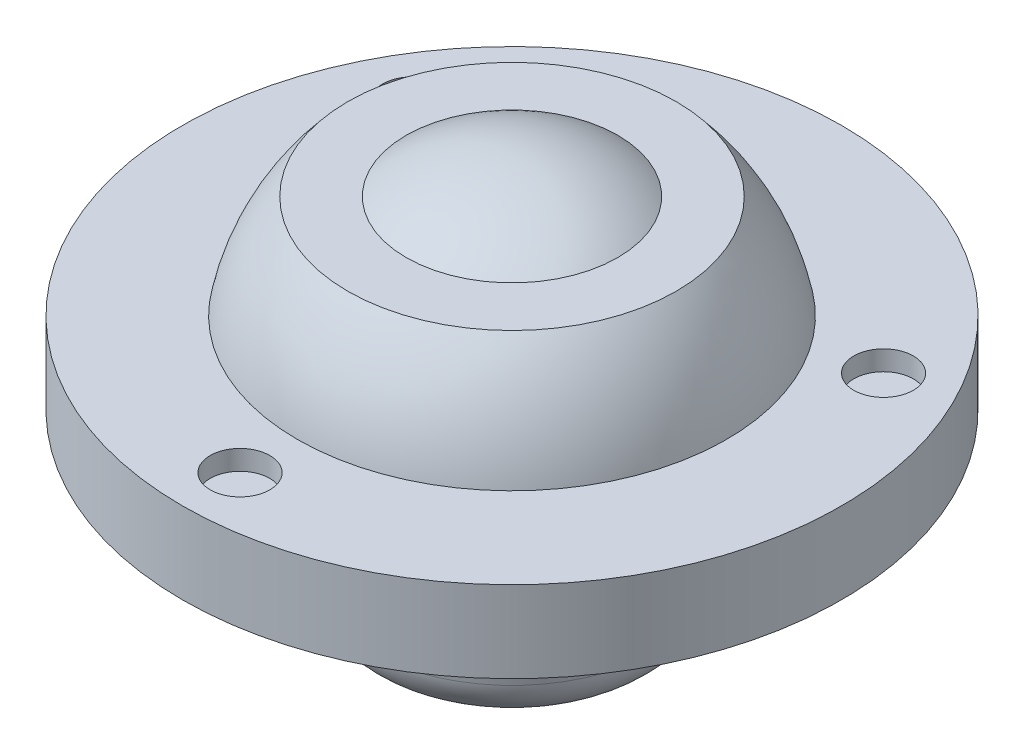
from build123d import *

# Parameters (mm, degrees)
ESQUISSE2_R             = 1.5
ENL_V_MAT_EXTRU_1_DEPTH = 10


with BuildPart() as part:
    # Esquisse1 → R_vol.-Mince1 (revolve)
    with BuildSketch(Plane(origin=(0, 0, 0), x_dir=(0, 0, -1), z_dir=(1, 0, 0))):
        with BuildLine():
            Line((0, -10), (-4.928339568, -10))
            ThreePointArc((-4.928339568, -10), (-5.912453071, -9.632042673), (-6.413750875, -8.708694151))
            Line((-6.413750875, -8.708694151), (-6.504557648, -8.062363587))
            ThreePointArc((-6.504557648, -8.062363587), (-6.653386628, -7.590214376), (-6.947799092, -7.192224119))
            ThreePointArc((-6.947799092, -7.192224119), (-8.987271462, -4.385082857), (-9.944722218, -1.05))
            Line((-9.944722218, -1.05), (-15.6, -1.05))
            Line((-15.6, -1.05), (-15.6, 1.05))
            Line((-15.6, 1.05), (-9.944722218, 1.05))
            ThreePointArc((-9.944722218, 1.05), (-9.248471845, 3.803389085), (-7.806247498, 6.25))
            Line((-7.806247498, 6.25), (-4.993746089, 6.25))
            ThreePointArc((-4.993746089, 6.25), (-2.645751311, 7.549834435), (0, 8))
            Line((0, 8), (0, 9))
            ThreePointArc((0, 9), (-2.80624304, 8.551315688), (-5.332682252, 7.25))
            Line((-5.332682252, 7.25), (-8.272696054, 7.25))
            ThreePointArc((-8.272696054, 7.25), (-9.887945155, 4.819599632), (-10.807289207, 2.05))
            Line((-10.807289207, 2.05), (-16.6, 2.05))
            Line((-16.6, 2.05), (-16.6, -2.05))
            Line((-16.6, -2.05), (-10.807289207, -2.05))
            ThreePointArc((-10.807289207, -2.05), (-9.679284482, -5.226035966), (-7.642579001, -7.911446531))
            ThreePointArc((-7.642579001, -7.911446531), (-7.544441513, -8.04410995), (-7.494831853, -8.20149302))
            Line((-7.494831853, -8.20149302), (-7.40402508, -8.847823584))
            ThreePointArc((-7.40402508, -8.847823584), (-6.568528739, -10.386737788), (-4.928339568, -11))
            Line((-4.928339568, -11), (0, -11))
            Line((0, -11), (0, -10))
        make_face()
    revolve(axis=Axis((0, 80.39840484, 0), (0, -1, 0)))

    # Esquisse2 → Enl_v. mat.-Extru.1 (cut)
    with BuildSketch(Plane(origin=(0, 2.05, 0), x_dir=(-1, 0, 0), z_dir=(0, 1, 0))):
        with Locations(Location((0, 13.7, 0), (0, 0, 90))):
            Circle(ESQUISSE2_R)
        with Locations(Location((11.864548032, -6.85, 0), (0, 0, 90))):
            Circle(ESQUISSE2_R)
        with Locations(Location((-11.864548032, -6.85, 0), (0, 0, 90))):
            Circle(ESQUISSE2_R)
    extrude(amount=-ENL_V_MAT_EXTRU_1_DEPTH, mode=Mode.SUBTRACT)


solid = part.part
